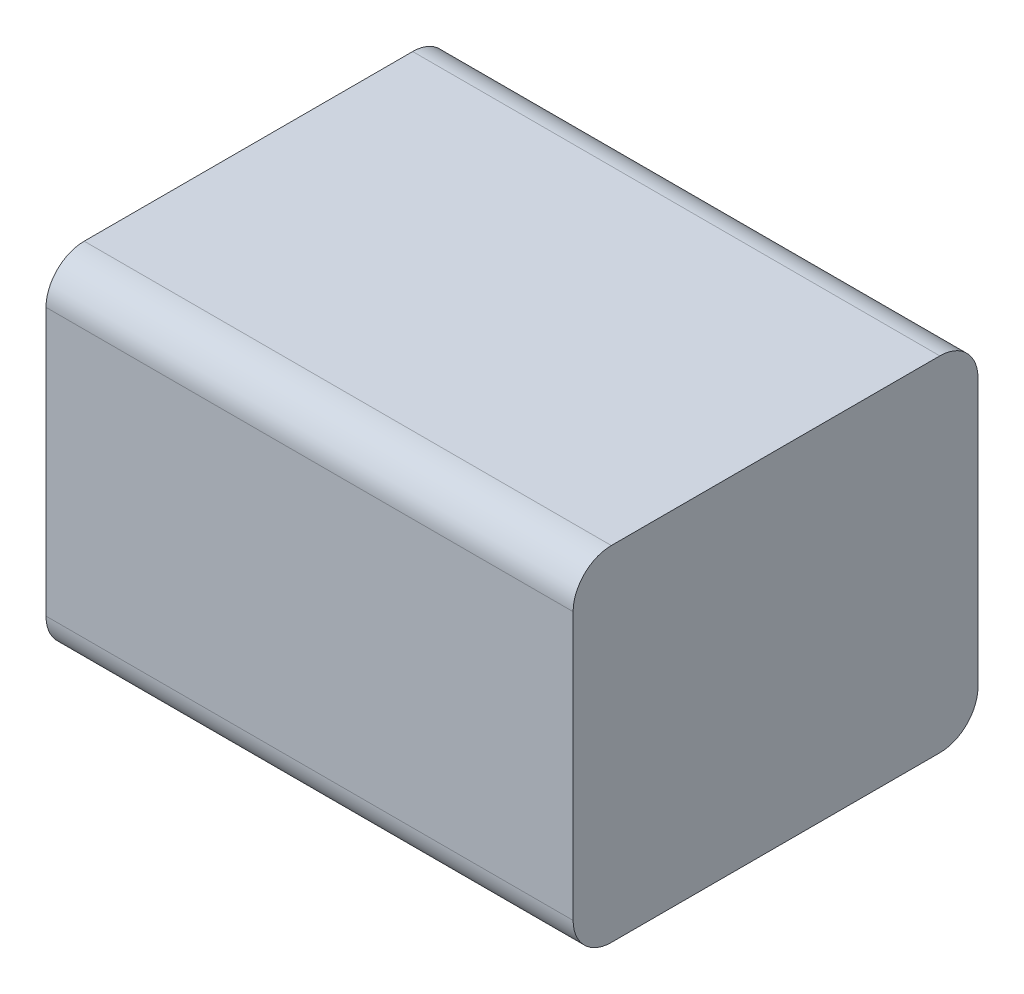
ISO-10303-21;
HEADER;
FILE_DESCRIPTION(('STEP AP214'),'2;1');
FILE_NAME('part.step','',(''),(''),'','','');
FILE_SCHEMA(('AUTOMOTIVE_DESIGN { 1 0 10303 214 1 1 1 1 }'));
ENDSEC;
DATA;
#1=APPLICATION_CONTEXT('core data for automotive mechanical design processes');
#2=APPLICATION_PROTOCOL_DEFINITION('international standard','automotive_design',2000,#1);
#3=PRODUCT_CONTEXT('',#1,'mechanical');
#4=PRODUCT('Part','Part','',(#3));
#5=PRODUCT_RELATED_PRODUCT_CATEGORY('part','',(#4));
#6=PRODUCT_DEFINITION_FORMATION('','',#4);
#7=PRODUCT_DEFINITION_CONTEXT('part definition',#1,'design');
#8=PRODUCT_DEFINITION('design','',#6,#7);
#9=PRODUCT_DEFINITION_SHAPE('','',#8);
#10=(LENGTH_UNIT() NAMED_UNIT(*) SI_UNIT(.MILLI.,.METRE.));
#11=(NAMED_UNIT(*) PLANE_ANGLE_UNIT() SI_UNIT($,.RADIAN.));
#12=(NAMED_UNIT(*) SI_UNIT($,.STERADIAN.) SOLID_ANGLE_UNIT());
#13=UNCERTAINTY_MEASURE_WITH_UNIT(LENGTH_MEASURE(1.E-05),#10,'distance_accuracy_value','');
#14=(GEOMETRIC_REPRESENTATION_CONTEXT(3) GLOBAL_UNCERTAINTY_ASSIGNED_CONTEXT((#13)) GLOBAL_UNIT_ASSIGNED_CONTEXT((#10,
#11,#12)) REPRESENTATION_CONTEXT('',''));
#15=CARTESIAN_POINT('',(0.,0.,0.));
#16=DIRECTION('',(0.,0.,1.));
#17=DIRECTION('',(1.,0.,0.));
#18=AXIS2_PLACEMENT_3D('',#15,#16,#17);
#19=CARTESIAN_POINT('',(58.65,-15.75,-18.55));
#20=DIRECTION('',(0.,0.,1.));
#21=DIRECTION('',(1.,0.,0.));
#22=AXIS2_PLACEMENT_3D('',#19,#20,#21);
#23=PLANE('',#22);
#24=DIRECTION('',(0.,1.,0.));
#25=VECTOR('',#24,1.);
#26=CARTESIAN_POINT('',(58.65,-15.75,-18.55));
#27=LINE('',#26,#25);
#28=CARTESIAN_POINT('',(58.65,-12.25,-18.55));
#29=VERTEX_POINT('',#28);
#30=CARTESIAN_POINT('',(58.65,12.25,-18.55));
#31=VERTEX_POINT('',#30);
#32=EDGE_CURVE('E135',#29,#31,#27,.T.);
#33=ORIENTED_EDGE('',*,*,#32,.F.);
#34=DIRECTION('',(-1.,0.,0.));
#35=VECTOR('',#34,1.);
#36=CARTESIAN_POINT('',(58.65,-12.25,-18.55));
#37=LINE('',#36,#35);
#38=CARTESIAN_POINT('',(10.35,-12.25,-18.55));
#39=VERTEX_POINT('',#38);
#40=EDGE_CURVE('E161',#29,#39,#37,.T.);
#41=ORIENTED_EDGE('',*,*,#40,.T.);
#42=DIRECTION('',(0.,1.,0.));
#43=VECTOR('',#42,1.);
#44=CARTESIAN_POINT('',(10.35,-15.75,-18.55));
#45=LINE('',#44,#43);
#46=CARTESIAN_POINT('',(10.35,12.25,-18.55));
#47=VERTEX_POINT('',#46);
#48=EDGE_CURVE('E169',#39,#47,#45,.T.);
#49=ORIENTED_EDGE('',*,*,#48,.T.);
#50=DIRECTION('',(-1.,0.,0.));
#51=VECTOR('',#50,1.);
#52=CARTESIAN_POINT('',(58.65,12.25,-18.55));
#53=LINE('',#52,#51);
#54=EDGE_CURVE('E159',#47,#31,#53,.F.);
#55=ORIENTED_EDGE('',*,*,#54,.T.);
#56=EDGE_LOOP('',(#33,#41,#49,#55));
#57=FACE_BOUND('',#56,.T.);
#58=ADVANCED_FACE('F44',(#57),#23,.F.);
#59=CARTESIAN_POINT('',(58.65,15.75,18.55));
#60=DIRECTION('',(0.,-1.,0.));
#61=DIRECTION('',(0.,0.,-1.));
#62=AXIS2_PLACEMENT_3D('',#59,#60,#61);
#63=PLANE('',#62);
#64=DIRECTION('',(0.,0.,1.));
#65=VECTOR('',#64,1.);
#66=CARTESIAN_POINT('',(10.35,15.75,18.55));
#67=LINE('',#66,#65);
#68=CARTESIAN_POINT('',(10.35,15.75,-15.05));
#69=VERTEX_POINT('',#68);
#70=CARTESIAN_POINT('',(10.35,15.75,15.05));
#71=VERTEX_POINT('',#70);
#72=EDGE_CURVE('E140',#69,#71,#67,.T.);
#73=ORIENTED_EDGE('',*,*,#72,.T.);
#74=DIRECTION('',(-1.,0.,0.));
#75=VECTOR('',#74,1.);
#76=CARTESIAN_POINT('',(58.65,15.75,15.05));
#77=LINE('',#76,#75);
#78=CARTESIAN_POINT('',(58.65,15.75,15.05));
#79=VERTEX_POINT('',#78);
#80=EDGE_CURVE('E12',#71,#79,#77,.F.);
#81=ORIENTED_EDGE('',*,*,#80,.T.);
#82=DIRECTION('',(0.,0.,1.));
#83=VECTOR('',#82,1.);
#84=CARTESIAN_POINT('',(58.65,15.75,18.55));
#85=LINE('',#84,#83);
#86=CARTESIAN_POINT('',(58.65,15.75,-15.05));
#87=VERTEX_POINT('',#86);
#88=EDGE_CURVE('E138',#87,#79,#85,.T.);
#89=ORIENTED_EDGE('',*,*,#88,.F.);
#90=DIRECTION('',(-1.,0.,0.));
#91=VECTOR('',#90,1.);
#92=CARTESIAN_POINT('',(58.65,15.75,-15.05));
#93=LINE('',#92,#91);
#94=EDGE_CURVE('E52',#87,#69,#93,.T.);
#95=ORIENTED_EDGE('',*,*,#94,.T.);
#96=EDGE_LOOP('',(#73,#81,#89,#95));
#97=FACE_BOUND('',#96,.T.);
#98=ADVANCED_FACE('F166',(#97),#63,.F.);
#99=CARTESIAN_POINT('',(58.65,-15.75,18.55));
#100=DIRECTION('',(0.,0.,-1.));
#101=DIRECTION('',(-1.,0.,0.));
#102=AXIS2_PLACEMENT_3D('',#99,#100,#101);
#103=PLANE('',#102);
#104=DIRECTION('',(0.,-1.,0.));
#105=VECTOR('',#104,1.);
#106=CARTESIAN_POINT('',(10.35,-15.75,18.55));
#107=LINE('',#106,#105);
#108=CARTESIAN_POINT('',(10.35,12.25,18.55));
#109=VERTEX_POINT('',#108);
#110=CARTESIAN_POINT('',(10.35,-12.25,18.55));
#111=VERTEX_POINT('',#110);
#112=EDGE_CURVE('E136',#109,#111,#107,.T.);
#113=ORIENTED_EDGE('',*,*,#112,.T.);
#114=DIRECTION('',(-1.,0.,0.));
#115=VECTOR('',#114,1.);
#116=CARTESIAN_POINT('',(58.65,-12.25,18.55));
#117=LINE('',#116,#115);
#118=CARTESIAN_POINT('',(58.65,-12.25,18.55));
#119=VERTEX_POINT('',#118);
#120=EDGE_CURVE('E114',#111,#119,#117,.F.);
#121=ORIENTED_EDGE('',*,*,#120,.T.);
#122=DIRECTION('',(0.,-1.,0.));
#123=VECTOR('',#122,1.);
#124=CARTESIAN_POINT('',(58.65,-15.75,18.55));
#125=LINE('',#124,#123);
#126=CARTESIAN_POINT('',(58.65,12.25,18.55));
#127=VERTEX_POINT('',#126);
#128=EDGE_CURVE('E173',#127,#119,#125,.T.);
#129=ORIENTED_EDGE('',*,*,#128,.F.);
#130=DIRECTION('',(-1.,0.,0.));
#131=VECTOR('',#130,1.);
#132=CARTESIAN_POINT('',(58.65,12.25,18.55));
#133=LINE('',#132,#131);
#134=EDGE_CURVE('E119',#127,#109,#133,.T.);
#135=ORIENTED_EDGE('',*,*,#134,.T.);
#136=EDGE_LOOP('',(#113,#121,#129,#135));
#137=FACE_BOUND('',#136,.T.);
#138=ADVANCED_FACE('F183',(#137),#103,.F.);
#139=CARTESIAN_POINT('',(58.65,-15.75,18.55));
#140=DIRECTION('',(0.,1.,0.));
#141=DIRECTION('',(0.,0.,1.));
#142=AXIS2_PLACEMENT_3D('',#139,#140,#141);
#143=PLANE('',#142);
#144=DIRECTION('',(0.,0.,-1.));
#145=VECTOR('',#144,1.);
#146=CARTESIAN_POINT('',(58.65,-15.75,18.55));
#147=LINE('',#146,#145);
#148=CARTESIAN_POINT('',(58.65,-15.75,15.05));
#149=VERTEX_POINT('',#148);
#150=CARTESIAN_POINT('',(58.65,-15.75,-15.05));
#151=VERTEX_POINT('',#150);
#152=EDGE_CURVE('E129',#149,#151,#147,.T.);
#153=ORIENTED_EDGE('',*,*,#152,.F.);
#154=DIRECTION('',(-1.,0.,0.));
#155=VECTOR('',#154,1.);
#156=CARTESIAN_POINT('',(58.65,-15.75,15.05));
#157=LINE('',#156,#155);
#158=CARTESIAN_POINT('',(10.35,-15.75,15.05));
#159=VERTEX_POINT('',#158);
#160=EDGE_CURVE('E113',#149,#159,#157,.T.);
#161=ORIENTED_EDGE('',*,*,#160,.T.);
#162=DIRECTION('',(0.,0.,-1.));
#163=VECTOR('',#162,1.);
#164=CARTESIAN_POINT('',(10.35,-15.75,18.55));
#165=LINE('',#164,#163);
#166=CARTESIAN_POINT('',(10.35,-15.75,-15.05));
#167=VERTEX_POINT('',#166);
#168=EDGE_CURVE('E126',#159,#167,#165,.T.);
#169=ORIENTED_EDGE('',*,*,#168,.T.);
#170=DIRECTION('',(-1.,0.,0.));
#171=VECTOR('',#170,1.);
#172=CARTESIAN_POINT('',(58.65,-15.75,-15.05));
#173=LINE('',#172,#171);
#174=EDGE_CURVE('E131',#167,#151,#173,.F.);
#175=ORIENTED_EDGE('',*,*,#174,.T.);
#176=EDGE_LOOP('',(#153,#161,#169,#175));
#177=FACE_BOUND('',#176,.T.);
#178=ADVANCED_FACE('F125',(#177),#143,.F.);
#179=CARTESIAN_POINT('',(58.65,0.,0.));
#180=DIRECTION('',(-1.,0.,0.));
#181=DIRECTION('',(0.,0.,1.));
#182=AXIS2_PLACEMENT_3D('',#179,#180,#181);
#183=PLANE('',#182);
#184=ORIENTED_EDGE('',*,*,#128,.T.);
#185=CARTESIAN_POINT('',(58.65,-12.25,15.05));
#186=DIRECTION('',(-1.,0.,0.));
#187=DIRECTION('',(0.,0.,1.));
#188=AXIS2_PLACEMENT_3D('',#185,#186,#187);
#189=CIRCLE('',#188,3.5);
#190=EDGE_CURVE('E157',#119,#149,#189,.F.);
#191=ORIENTED_EDGE('',*,*,#190,.T.);
#192=ORIENTED_EDGE('',*,*,#152,.T.);
#193=CARTESIAN_POINT('',(58.65,-12.25,-15.05));
#194=DIRECTION('',(-1.,0.,0.));
#195=DIRECTION('',(0.,0.,1.));
#196=AXIS2_PLACEMENT_3D('',#193,#194,#195);
#197=CIRCLE('',#196,3.5);
#198=EDGE_CURVE('E155',#151,#29,#197,.F.);
#199=ORIENTED_EDGE('',*,*,#198,.T.);
#200=ORIENTED_EDGE('',*,*,#32,.T.);
#201=CARTESIAN_POINT('',(58.65,12.25,-15.05));
#202=DIRECTION('',(-1.,0.,0.));
#203=DIRECTION('',(0.,0.,1.));
#204=AXIS2_PLACEMENT_3D('',#201,#202,#203);
#205=CIRCLE('',#204,3.5);
#206=EDGE_CURVE('E64',#31,#87,#205,.F.);
#207=ORIENTED_EDGE('',*,*,#206,.T.);
#208=ORIENTED_EDGE('',*,*,#88,.T.);
#209=CARTESIAN_POINT('',(58.65,12.25,15.05));
#210=DIRECTION('',(-1.,0.,0.));
#211=DIRECTION('',(0.,0.,1.));
#212=AXIS2_PLACEMENT_3D('',#209,#210,#211);
#213=CIRCLE('',#212,3.5);
#214=EDGE_CURVE('E153',#79,#127,#213,.F.);
#215=ORIENTED_EDGE('',*,*,#214,.T.);
#216=EDGE_LOOP('',(#184,#191,#192,#199,#200,#207,#208,#215));
#217=FACE_BOUND('',#216,.T.);
#218=ADVANCED_FACE('F177',(#217),#183,.F.);
#219=CARTESIAN_POINT('',(10.35,0.,0.));
#220=DIRECTION('',(-1.,0.,0.));
#221=DIRECTION('',(0.,0.,1.));
#222=AXIS2_PLACEMENT_3D('',#219,#220,#221);
#223=PLANE('',#222);
#224=ORIENTED_EDGE('',*,*,#168,.F.);
#225=CARTESIAN_POINT('',(10.35,-12.25,15.05));
#226=DIRECTION('',(-1.,0.,0.));
#227=DIRECTION('',(0.,0.,1.));
#228=AXIS2_PLACEMENT_3D('',#225,#226,#227);
#229=CIRCLE('',#228,3.5);
#230=EDGE_CURVE('E109',#159,#111,#229,.T.);
#231=ORIENTED_EDGE('',*,*,#230,.T.);
#232=ORIENTED_EDGE('',*,*,#112,.F.);
#233=CARTESIAN_POINT('',(10.35,12.25,15.05));
#234=DIRECTION('',(-1.,0.,0.));
#235=DIRECTION('',(0.,0.,1.));
#236=AXIS2_PLACEMENT_3D('',#233,#234,#235);
#237=CIRCLE('',#236,3.5);
#238=EDGE_CURVE('E146',#109,#71,#237,.T.);
#239=ORIENTED_EDGE('',*,*,#238,.T.);
#240=ORIENTED_EDGE('',*,*,#72,.F.);
#241=CARTESIAN_POINT('',(10.35,12.25,-15.05));
#242=DIRECTION('',(-1.,0.,0.));
#243=DIRECTION('',(0.,0.,1.));
#244=AXIS2_PLACEMENT_3D('',#241,#242,#243);
#245=CIRCLE('',#244,3.5);
#246=EDGE_CURVE('E130',#69,#47,#245,.T.);
#247=ORIENTED_EDGE('',*,*,#246,.T.);
#248=ORIENTED_EDGE('',*,*,#48,.F.);
#249=CARTESIAN_POINT('',(10.35,-12.25,-15.05));
#250=DIRECTION('',(-1.,0.,0.));
#251=DIRECTION('',(0.,0.,1.));
#252=AXIS2_PLACEMENT_3D('',#249,#250,#251);
#253=CIRCLE('',#252,3.5);
#254=EDGE_CURVE('E120',#39,#167,#253,.T.);
#255=ORIENTED_EDGE('',*,*,#254,.T.);
#256=EDGE_LOOP('',(#224,#231,#232,#239,#240,#247,#248,#255));
#257=FACE_BOUND('',#256,.T.);
#258=ADVANCED_FACE('F133',(#257),#223,.T.);
#259=CARTESIAN_POINT('',(58.65,-12.25,15.05));
#260=DIRECTION('',(-1.,0.,0.));
#261=DIRECTION('',(0.,0.,1.));
#262=AXIS2_PLACEMENT_3D('',#259,#260,#261);
#263=CYLINDRICAL_SURFACE('',#262,3.5);
#264=ORIENTED_EDGE('',*,*,#190,.F.);
#265=ORIENTED_EDGE('',*,*,#120,.F.);
#266=ORIENTED_EDGE('',*,*,#230,.F.);
#267=ORIENTED_EDGE('',*,*,#160,.F.);
#268=EDGE_LOOP('',(#264,#265,#266,#267));
#269=FACE_BOUND('',#268,.T.);
#270=ADVANCED_FACE('F112',(#269),#263,.T.);
#271=CARTESIAN_POINT('',(58.65,-12.25,-15.05));
#272=DIRECTION('',(-1.,0.,0.));
#273=DIRECTION('',(0.,0.,1.));
#274=AXIS2_PLACEMENT_3D('',#271,#272,#273);
#275=CYLINDRICAL_SURFACE('',#274,3.5);
#276=ORIENTED_EDGE('',*,*,#198,.F.);
#277=ORIENTED_EDGE('',*,*,#174,.F.);
#278=ORIENTED_EDGE('',*,*,#254,.F.);
#279=ORIENTED_EDGE('',*,*,#40,.F.);
#280=EDGE_LOOP('',(#276,#277,#278,#279));
#281=FACE_BOUND('',#280,.T.);
#282=ADVANCED_FACE('F188',(#281),#275,.T.);
#283=CARTESIAN_POINT('',(58.65,12.25,15.05));
#284=DIRECTION('',(-1.,0.,0.));
#285=DIRECTION('',(0.,0.,1.));
#286=AXIS2_PLACEMENT_3D('',#283,#284,#285);
#287=CYLINDRICAL_SURFACE('',#286,3.5);
#288=ORIENTED_EDGE('',*,*,#214,.F.);
#289=ORIENTED_EDGE('',*,*,#80,.F.);
#290=ORIENTED_EDGE('',*,*,#238,.F.);
#291=ORIENTED_EDGE('',*,*,#134,.F.);
#292=EDGE_LOOP('',(#288,#289,#290,#291));
#293=FACE_BOUND('',#292,.T.);
#294=ADVANCED_FACE('F181',(#293),#287,.T.);
#295=CARTESIAN_POINT('',(58.65,12.25,-15.05));
#296=DIRECTION('',(-1.,0.,0.));
#297=DIRECTION('',(0.,0.,1.));
#298=AXIS2_PLACEMENT_3D('',#295,#296,#297);
#299=CYLINDRICAL_SURFACE('',#298,3.5);
#300=ORIENTED_EDGE('',*,*,#206,.F.);
#301=ORIENTED_EDGE('',*,*,#54,.F.);
#302=ORIENTED_EDGE('',*,*,#246,.F.);
#303=ORIENTED_EDGE('',*,*,#94,.F.);
#304=EDGE_LOOP('',(#300,#301,#302,#303));
#305=FACE_BOUND('',#304,.T.);
#306=ADVANCED_FACE('F46',(#305),#299,.T.);
#307=CLOSED_SHELL('',(#58,#98,#138,#178,#218,#258,#270,#282,#294,#306));
#308=MANIFOLD_SOLID_BREP('B2',#307);
#309=ADVANCED_BREP_SHAPE_REPRESENTATION('',(#18,#308),#14);
#310=SHAPE_DEFINITION_REPRESENTATION(#9,#309);
ENDSEC;
END-ISO-10303-21;
